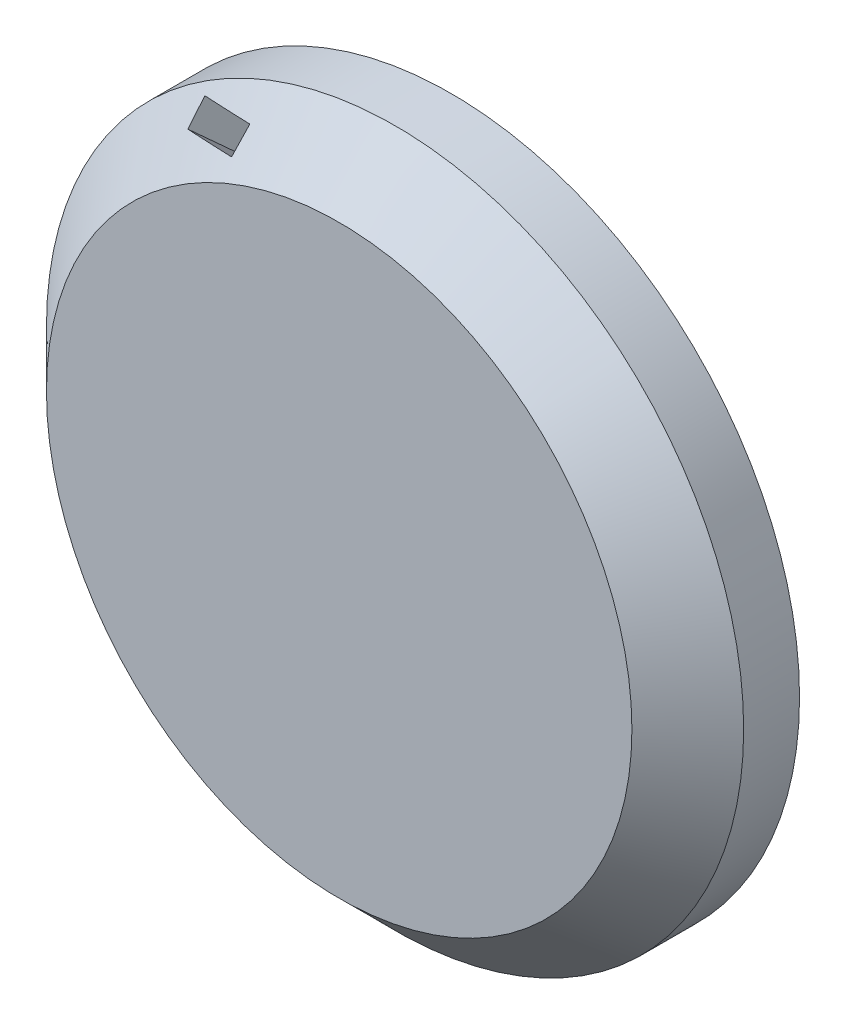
from build123d import *

# Parameters (mm, degrees)
SKIZZE1_R                       = 62.389337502
LINEAR_AUSTRAGEN1_DEPTH         = 20
FASE1_SIZE                      = 10
SKIZZE3_W                       = 11.462089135
SKIZZE3_H                       = 4.759354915
SCHNITT_LINEAR_AUSTRAGEN1_DEPTH = 10


with BuildPart() as part:
    # Skizze1 → Linear austragen1 (new body)
    with BuildSketch(Plane.XY):
        Circle(SKIZZE1_R)
    extrude(amount=-LINEAR_AUSTRAGEN1_DEPTH)

    # Fase1
    fase1_edges = [part.edges().sort_by_distance(p)[0] for p in [
        (-62.389337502, 0, 0),
    ]]
    chamfer(fase1_edges, length=FASE1_SIZE)

    # Skizze3 → Schnitt-Linear austragen1 (cut)
    with BuildSketch(Plane(origin=(-13.097334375, 22.685248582, 26.194668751), x_dir=(0.9354143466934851, 0.23145502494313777, 0.2672612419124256), z_dir=(-0.3535533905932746, 0.6123724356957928, 0.7071067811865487))):
        with Locations((-15.094126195, 42.114641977)):
            Rectangle(SKIZZE3_W, SKIZZE3_H)
    extrude(amount=-SCHNITT_LINEAR_AUSTRAGEN1_DEPTH, mode=Mode.SUBTRACT)


solid = part.part
